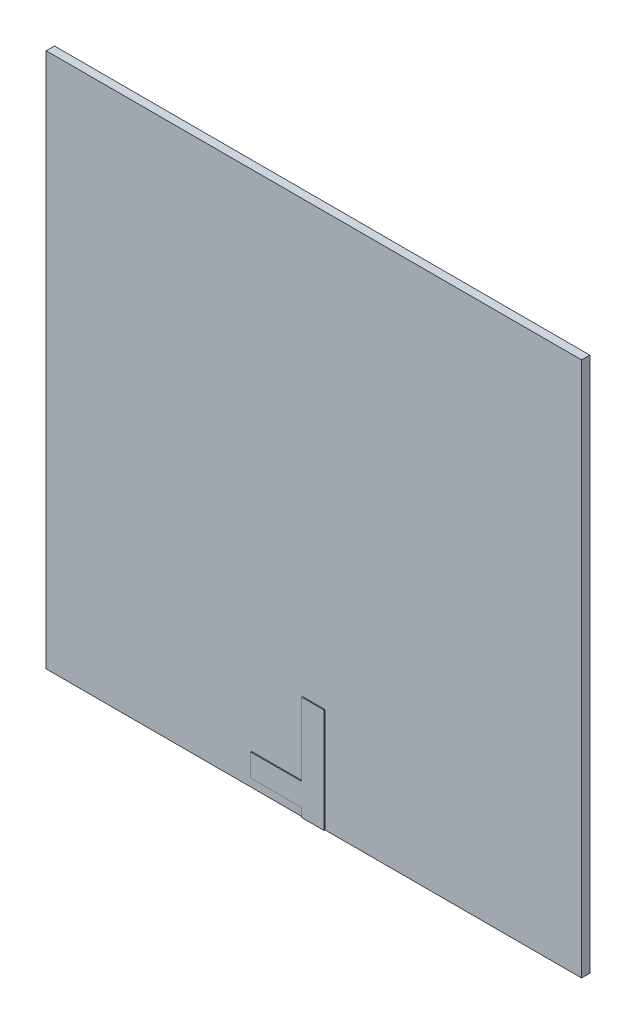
ISO-10303-21;
HEADER;
FILE_DESCRIPTION(('STEP AP214'),'2;1');
FILE_NAME('part.step','',(''),(''),'','','');
FILE_SCHEMA(('AUTOMOTIVE_DESIGN { 1 0 10303 214 1 1 1 1 }'));
ENDSEC;
DATA;
#1=APPLICATION_CONTEXT('core data for automotive mechanical design processes');
#2=APPLICATION_PROTOCOL_DEFINITION('international standard','automotive_design',2000,#1);
#3=PRODUCT_CONTEXT('',#1,'mechanical');
#4=PRODUCT('Part','Part','',(#3));
#5=PRODUCT_RELATED_PRODUCT_CATEGORY('part','',(#4));
#6=PRODUCT_DEFINITION_FORMATION('','',#4);
#7=PRODUCT_DEFINITION_CONTEXT('part definition',#1,'design');
#8=PRODUCT_DEFINITION('design','',#6,#7);
#9=PRODUCT_DEFINITION_SHAPE('','',#8);
#10=(LENGTH_UNIT() NAMED_UNIT(*) SI_UNIT(.MILLI.,.METRE.));
#11=(NAMED_UNIT(*) PLANE_ANGLE_UNIT() SI_UNIT($,.RADIAN.));
#12=(NAMED_UNIT(*) SI_UNIT($,.STERADIAN.) SOLID_ANGLE_UNIT());
#13=UNCERTAINTY_MEASURE_WITH_UNIT(LENGTH_MEASURE(1.E-05),#10,'distance_accuracy_value','');
#14=(GEOMETRIC_REPRESENTATION_CONTEXT(3) GLOBAL_UNCERTAINTY_ASSIGNED_CONTEXT((#13)) GLOBAL_UNIT_ASSIGNED_CONTEXT((#10,
#11,#12)) REPRESENTATION_CONTEXT('',''));
#15=CARTESIAN_POINT('',(0.,0.,0.));
#16=DIRECTION('',(0.,0.,1.));
#17=DIRECTION('',(1.,0.,0.));
#18=AXIS2_PLACEMENT_3D('',#15,#16,#17);
#19=CARTESIAN_POINT('',(-55.,55.,1.9));
#20=DIRECTION('',(1.,0.,0.));
#21=DIRECTION('',(0.,1.,0.));
#22=AXIS2_PLACEMENT_3D('',#19,#20,#21);
#23=PLANE('',#22);
#24=DIRECTION('',(0.,0.,-1.));
#25=VECTOR('',#24,1.);
#26=CARTESIAN_POINT('',(-55.,-55.,1.9));
#27=LINE('',#26,#25);
#28=CARTESIAN_POINT('',(-55.,-55.,1.7));
#29=VERTEX_POINT('',#28);
#30=CARTESIAN_POINT('',(-55.,-55.,0.));
#31=VERTEX_POINT('',#30);
#32=EDGE_CURVE('E11',#29,#31,#27,.T.);
#33=ORIENTED_EDGE('',*,*,#32,.F.);
#34=DIRECTION('',(0.,-1.,0.));
#35=VECTOR('',#34,1.);
#36=CARTESIAN_POINT('',(-55.,-55.,1.7));
#37=LINE('',#36,#35);
#38=CARTESIAN_POINT('',(-55.,55.,1.7));
#39=VERTEX_POINT('',#38);
#40=EDGE_CURVE('E185',#39,#29,#37,.T.);
#41=ORIENTED_EDGE('',*,*,#40,.F.);
#42=DIRECTION('',(0.,0.,-1.));
#43=VECTOR('',#42,1.);
#44=CARTESIAN_POINT('',(-55.,55.,1.9));
#45=LINE('',#44,#43);
#46=CARTESIAN_POINT('',(-55.,55.,0.));
#47=VERTEX_POINT('',#46);
#48=EDGE_CURVE('E62',#39,#47,#45,.T.);
#49=ORIENTED_EDGE('',*,*,#48,.T.);
#50=DIRECTION('',(0.,-1.,0.));
#51=VECTOR('',#50,1.);
#52=CARTESIAN_POINT('',(-55.,55.,0.));
#53=LINE('',#52,#51);
#54=EDGE_CURVE('E213',#47,#31,#53,.T.);
#55=ORIENTED_EDGE('',*,*,#54,.T.);
#56=EDGE_LOOP('',(#33,#41,#49,#55));
#57=FACE_BOUND('',#56,.T.);
#58=ADVANCED_FACE('F39',(#57),#23,.F.);
#59=CARTESIAN_POINT('',(-55.,-55.,1.9));
#60=DIRECTION('',(0.,1.,0.));
#61=DIRECTION('',(0.,0.,1.));
#62=AXIS2_PLACEMENT_3D('',#59,#60,#61);
#63=PLANE('',#62);
#64=DIRECTION('',(1.,0.,0.));
#65=VECTOR('',#64,1.);
#66=CARTESIAN_POINT('',(55.,-55.,1.7));
#67=LINE('',#66,#65);
#68=CARTESIAN_POINT('',(2.315,-55.,1.7));
#69=VERTEX_POINT('',#68);
#70=CARTESIAN_POINT('',(55.,-55.,1.7));
#71=VERTEX_POINT('',#70);
#72=EDGE_CURVE('E176',#69,#71,#67,.T.);
#73=ORIENTED_EDGE('',*,*,#72,.F.);
#74=DIRECTION('',(0.,0.,1.));
#75=VECTOR('',#74,1.);
#76=CARTESIAN_POINT('',(2.315,-55.,1.7));
#77=LINE('',#76,#75);
#78=CARTESIAN_POINT('',(2.315,-55.,1.9));
#79=VERTEX_POINT('',#78);
#80=EDGE_CURVE('E214',#69,#79,#77,.T.);
#81=ORIENTED_EDGE('',*,*,#80,.T.);
#82=DIRECTION('',(1.,0.,0.));
#83=VECTOR('',#82,1.);
#84=CARTESIAN_POINT('',(-55.,-55.,1.9));
#85=LINE('',#84,#83);
#86=CARTESIAN_POINT('',(-2.315,-55.,1.9));
#87=VERTEX_POINT('',#86);
#88=EDGE_CURVE('E232',#87,#79,#85,.T.);
#89=ORIENTED_EDGE('',*,*,#88,.F.);
#90=DIRECTION('',(0.,0.,1.));
#91=VECTOR('',#90,1.);
#92=CARTESIAN_POINT('',(-2.315,-55.,1.7));
#93=LINE('',#92,#91);
#94=CARTESIAN_POINT('',(-2.315,-55.,1.7));
#95=VERTEX_POINT('',#94);
#96=EDGE_CURVE('E210',#95,#87,#93,.T.);
#97=ORIENTED_EDGE('',*,*,#96,.F.);
#98=DIRECTION('',(1.,0.,0.));
#99=VECTOR('',#98,1.);
#100=CARTESIAN_POINT('',(-2.315,-55.,1.7));
#101=LINE('',#100,#99);
#102=EDGE_CURVE('E137',#29,#95,#101,.T.);
#103=ORIENTED_EDGE('',*,*,#102,.F.);
#104=ORIENTED_EDGE('',*,*,#32,.T.);
#105=DIRECTION('',(1.,0.,0.));
#106=VECTOR('',#105,1.);
#107=CARTESIAN_POINT('',(-55.,-55.,0.));
#108=LINE('',#107,#106);
#109=CARTESIAN_POINT('',(55.,-55.,0.));
#110=VERTEX_POINT('',#109);
#111=EDGE_CURVE('E239',#31,#110,#108,.T.);
#112=ORIENTED_EDGE('',*,*,#111,.T.);
#113=DIRECTION('',(0.,0.,-1.));
#114=VECTOR('',#113,1.);
#115=CARTESIAN_POINT('',(55.,-55.,1.9));
#116=LINE('',#115,#114);
#117=EDGE_CURVE('E47',#71,#110,#116,.T.);
#118=ORIENTED_EDGE('',*,*,#117,.F.);
#119=EDGE_LOOP('',(#73,#81,#89,#97,#103,#104,#112,#118));
#120=FACE_BOUND('',#119,.T.);
#121=ADVANCED_FACE('F264',(#120),#63,.F.);
#122=CARTESIAN_POINT('',(55.,55.,1.9));
#123=DIRECTION('',(-1.,0.,0.));
#124=DIRECTION('',(0.,-1.,0.));
#125=AXIS2_PLACEMENT_3D('',#122,#123,#124);
#126=PLANE('',#125);
#127=DIRECTION('',(0.,0.,-1.));
#128=VECTOR('',#127,1.);
#129=CARTESIAN_POINT('',(55.,55.,1.9));
#130=LINE('',#129,#128);
#131=CARTESIAN_POINT('',(55.,55.,1.7));
#132=VERTEX_POINT('',#131);
#133=CARTESIAN_POINT('',(55.,55.,0.));
#134=VERTEX_POINT('',#133);
#135=EDGE_CURVE('E251',#132,#134,#130,.T.);
#136=ORIENTED_EDGE('',*,*,#135,.F.);
#137=DIRECTION('',(0.,1.,0.));
#138=VECTOR('',#137,1.);
#139=CARTESIAN_POINT('',(55.,55.,1.7));
#140=LINE('',#139,#138);
#141=EDGE_CURVE('E179',#71,#132,#140,.T.);
#142=ORIENTED_EDGE('',*,*,#141,.F.);
#143=ORIENTED_EDGE('',*,*,#117,.T.);
#144=DIRECTION('',(0.,1.,0.));
#145=VECTOR('',#144,1.);
#146=CARTESIAN_POINT('',(55.,55.,0.));
#147=LINE('',#146,#145);
#148=EDGE_CURVE('E243',#110,#134,#147,.T.);
#149=ORIENTED_EDGE('',*,*,#148,.T.);
#150=EDGE_LOOP('',(#136,#142,#143,#149));
#151=FACE_BOUND('',#150,.T.);
#152=ADVANCED_FACE('F258',(#151),#126,.F.);
#153=CARTESIAN_POINT('',(-55.,55.,1.9));
#154=DIRECTION('',(0.,-1.,0.));
#155=DIRECTION('',(0.,0.,-1.));
#156=AXIS2_PLACEMENT_3D('',#153,#154,#155);
#157=PLANE('',#156);
#158=ORIENTED_EDGE('',*,*,#48,.F.);
#159=DIRECTION('',(-1.,0.,0.));
#160=VECTOR('',#159,1.);
#161=CARTESIAN_POINT('',(-55.,55.,1.7));
#162=LINE('',#161,#160);
#163=EDGE_CURVE('E182',#132,#39,#162,.T.);
#164=ORIENTED_EDGE('',*,*,#163,.F.);
#165=ORIENTED_EDGE('',*,*,#135,.T.);
#166=DIRECTION('',(-1.,0.,0.));
#167=VECTOR('',#166,1.);
#168=CARTESIAN_POINT('',(-55.,55.,0.));
#169=LINE('',#168,#167);
#170=EDGE_CURVE('E236',#134,#47,#169,.T.);
#171=ORIENTED_EDGE('',*,*,#170,.T.);
#172=EDGE_LOOP('',(#158,#164,#165,#171));
#173=FACE_BOUND('',#172,.T.);
#174=ADVANCED_FACE('F270',(#173),#157,.F.);
#175=CARTESIAN_POINT('',(0.,0.,1.9));
#176=DIRECTION('',(0.,0.,1.));
#177=DIRECTION('',(1.,0.,0.));
#178=AXIS2_PLACEMENT_3D('',#175,#176,#177);
#179=PLANE('',#178);
#180=DIRECTION('',(0.,1.,0.));
#181=VECTOR('',#180,1.);
#182=CARTESIAN_POINT('',(-2.315,-53.205,1.9));
#183=LINE('',#182,#181);
#184=CARTESIAN_POINT('',(-2.315,-53.205,1.9));
#185=VERTEX_POINT('',#184);
#186=EDGE_CURVE('E54',#87,#185,#183,.T.);
#187=ORIENTED_EDGE('',*,*,#186,.F.);
#188=ORIENTED_EDGE('',*,*,#88,.T.);
#189=DIRECTION('',(0.,-1.,0.));
#190=VECTOR('',#189,1.);
#191=CARTESIAN_POINT('',(2.315,-55.,1.9));
#192=LINE('',#191,#190);
#193=CARTESIAN_POINT('',(2.315,-33.575,1.9));
#194=VERTEX_POINT('',#193);
#195=EDGE_CURVE('E152',#194,#79,#192,.T.);
#196=ORIENTED_EDGE('',*,*,#195,.F.);
#197=DIRECTION('',(1.,0.,0.));
#198=VECTOR('',#197,1.);
#199=CARTESIAN_POINT('',(2.315,-33.575,1.9));
#200=LINE('',#199,#198);
#201=CARTESIAN_POINT('',(-2.315,-33.575,1.9));
#202=VERTEX_POINT('',#201);
#203=EDGE_CURVE('E155',#202,#194,#200,.T.);
#204=ORIENTED_EDGE('',*,*,#203,.F.);
#205=DIRECTION('',(0.,1.,0.));
#206=VECTOR('',#205,1.);
#207=CARTESIAN_POINT('',(-2.315,-33.575,1.9));
#208=LINE('',#207,#206);
#209=CARTESIAN_POINT('',(-2.315,-48.575,1.9));
#210=VERTEX_POINT('',#209);
#211=EDGE_CURVE('E203',#210,#202,#208,.T.);
#212=ORIENTED_EDGE('',*,*,#211,.F.);
#213=DIRECTION('',(1.,0.,0.));
#214=VECTOR('',#213,1.);
#215=CARTESIAN_POINT('',(-2.315,-48.575,1.9));
#216=LINE('',#215,#214);
#217=CARTESIAN_POINT('',(-12.815,-48.575,1.9));
#218=VERTEX_POINT('',#217);
#219=EDGE_CURVE('E199',#218,#210,#216,.T.);
#220=ORIENTED_EDGE('',*,*,#219,.F.);
#221=DIRECTION('',(0.,1.,0.));
#222=VECTOR('',#221,1.);
#223=CARTESIAN_POINT('',(-12.815,-48.575,1.9));
#224=LINE('',#223,#222);
#225=CARTESIAN_POINT('',(-12.815,-53.205,1.9));
#226=VERTEX_POINT('',#225);
#227=EDGE_CURVE('E195',#226,#218,#224,.T.);
#228=ORIENTED_EDGE('',*,*,#227,.F.);
#229=DIRECTION('',(-1.,0.,0.));
#230=VECTOR('',#229,1.);
#231=CARTESIAN_POINT('',(-12.815,-53.205,1.9));
#232=LINE('',#231,#230);
#233=EDGE_CURVE('E192',#185,#226,#232,.T.);
#234=ORIENTED_EDGE('',*,*,#233,.F.);
#235=EDGE_LOOP('',(#187,#188,#196,#204,#212,#220,#228,#234));
#236=FACE_BOUND('',#235,.T.);
#237=ADVANCED_FACE('F283',(#236),#179,.T.);
#238=CARTESIAN_POINT('',(0.,0.,0.));
#239=DIRECTION('',(0.,0.,1.));
#240=DIRECTION('',(1.,0.,0.));
#241=AXIS2_PLACEMENT_3D('',#238,#239,#240);
#242=PLANE('',#241);
#243=ORIENTED_EDGE('',*,*,#54,.F.);
#244=ORIENTED_EDGE('',*,*,#170,.F.);
#245=ORIENTED_EDGE('',*,*,#148,.F.);
#246=ORIENTED_EDGE('',*,*,#111,.F.);
#247=EDGE_LOOP('',(#243,#244,#245,#246));
#248=FACE_BOUND('',#247,.T.);
#249=ADVANCED_FACE('F268',(#248),#242,.F.);
#250=CARTESIAN_POINT('',(-2.315,-53.205,1.7));
#251=DIRECTION('',(1.,0.,0.));
#252=DIRECTION('',(0.,0.,-1.));
#253=AXIS2_PLACEMENT_3D('',#250,#251,#252);
#254=PLANE('',#253);
#255=ORIENTED_EDGE('',*,*,#186,.T.);
#256=DIRECTION('',(0.,0.,1.));
#257=VECTOR('',#256,1.);
#258=CARTESIAN_POINT('',(-2.315,-53.205,1.7));
#259=LINE('',#258,#257);
#260=CARTESIAN_POINT('',(-2.315,-53.205,1.7));
#261=VERTEX_POINT('',#260);
#262=EDGE_CURVE('E126',#261,#185,#259,.T.);
#263=ORIENTED_EDGE('',*,*,#262,.F.);
#264=DIRECTION('',(0.,1.,0.));
#265=VECTOR('',#264,1.);
#266=CARTESIAN_POINT('',(-2.315,-53.205,1.7));
#267=LINE('',#266,#265);
#268=EDGE_CURVE('E130',#95,#261,#267,.T.);
#269=ORIENTED_EDGE('',*,*,#268,.F.);
#270=ORIENTED_EDGE('',*,*,#96,.T.);
#271=EDGE_LOOP('',(#255,#263,#269,#270));
#272=FACE_BOUND('',#271,.T.);
#273=ADVANCED_FACE('F128',(#272),#254,.F.);
#274=CARTESIAN_POINT('',(2.315,-55.,1.7));
#275=DIRECTION('',(-1.,0.,0.));
#276=DIRECTION('',(0.,-1.,0.));
#277=AXIS2_PLACEMENT_3D('',#274,#275,#276);
#278=PLANE('',#277);
#279=ORIENTED_EDGE('',*,*,#195,.T.);
#280=ORIENTED_EDGE('',*,*,#80,.F.);
#281=DIRECTION('',(0.,-1.,0.));
#282=VECTOR('',#281,1.);
#283=CARTESIAN_POINT('',(2.315,-55.,1.7));
#284=LINE('',#283,#282);
#285=CARTESIAN_POINT('',(2.315,-33.575,1.7));
#286=VERTEX_POINT('',#285);
#287=EDGE_CURVE('E172',#286,#69,#284,.T.);
#288=ORIENTED_EDGE('',*,*,#287,.F.);
#289=DIRECTION('',(0.,0.,1.));
#290=VECTOR('',#289,1.);
#291=CARTESIAN_POINT('',(2.315,-33.575,1.7));
#292=LINE('',#291,#290);
#293=EDGE_CURVE('E218',#286,#194,#292,.T.);
#294=ORIENTED_EDGE('',*,*,#293,.T.);
#295=EDGE_LOOP('',(#279,#280,#288,#294));
#296=FACE_BOUND('',#295,.T.);
#297=ADVANCED_FACE('F291',(#296),#278,.F.);
#298=CARTESIAN_POINT('',(2.315,-33.575,1.7));
#299=DIRECTION('',(0.,-1.,0.));
#300=DIRECTION('',(0.,0.,-1.));
#301=AXIS2_PLACEMENT_3D('',#298,#299,#300);
#302=PLANE('',#301);
#303=ORIENTED_EDGE('',*,*,#203,.T.);
#304=ORIENTED_EDGE('',*,*,#293,.F.);
#305=DIRECTION('',(1.,0.,0.));
#306=VECTOR('',#305,1.);
#307=CARTESIAN_POINT('',(2.315,-33.575,1.7));
#308=LINE('',#307,#306);
#309=CARTESIAN_POINT('',(-2.315,-33.575,1.7));
#310=VERTEX_POINT('',#309);
#311=EDGE_CURVE('E168',#310,#286,#308,.T.);
#312=ORIENTED_EDGE('',*,*,#311,.F.);
#313=DIRECTION('',(0.,0.,1.));
#314=VECTOR('',#313,1.);
#315=CARTESIAN_POINT('',(-2.315,-33.575,1.7));
#316=LINE('',#315,#314);
#317=EDGE_CURVE('E221',#310,#202,#316,.T.);
#318=ORIENTED_EDGE('',*,*,#317,.T.);
#319=EDGE_LOOP('',(#303,#304,#312,#318));
#320=FACE_BOUND('',#319,.T.);
#321=ADVANCED_FACE('F305',(#320),#302,.F.);
#322=CARTESIAN_POINT('',(-2.315,-33.575,1.7));
#323=DIRECTION('',(1.,0.,0.));
#324=DIRECTION('',(0.,0.,-1.));
#325=AXIS2_PLACEMENT_3D('',#322,#323,#324);
#326=PLANE('',#325);
#327=ORIENTED_EDGE('',*,*,#211,.T.);
#328=ORIENTED_EDGE('',*,*,#317,.F.);
#329=DIRECTION('',(0.,1.,0.));
#330=VECTOR('',#329,1.);
#331=CARTESIAN_POINT('',(-2.315,-33.575,1.7));
#332=LINE('',#331,#330);
#333=CARTESIAN_POINT('',(-2.315,-48.575,1.7));
#334=VERTEX_POINT('',#333);
#335=EDGE_CURVE('E164',#334,#310,#332,.T.);
#336=ORIENTED_EDGE('',*,*,#335,.F.);
#337=DIRECTION('',(0.,0.,1.));
#338=VECTOR('',#337,1.);
#339=CARTESIAN_POINT('',(-2.315,-48.575,1.7));
#340=LINE('',#339,#338);
#341=EDGE_CURVE('E224',#334,#210,#340,.T.);
#342=ORIENTED_EDGE('',*,*,#341,.T.);
#343=EDGE_LOOP('',(#327,#328,#336,#342));
#344=FACE_BOUND('',#343,.T.);
#345=ADVANCED_FACE('F301',(#344),#326,.F.);
#346=CARTESIAN_POINT('',(-2.315,-48.575,1.7));
#347=DIRECTION('',(0.,-1.,0.));
#348=DIRECTION('',(0.,0.,-1.));
#349=AXIS2_PLACEMENT_3D('',#346,#347,#348);
#350=PLANE('',#349);
#351=ORIENTED_EDGE('',*,*,#219,.T.);
#352=ORIENTED_EDGE('',*,*,#341,.F.);
#353=DIRECTION('',(1.,0.,0.));
#354=VECTOR('',#353,1.);
#355=CARTESIAN_POINT('',(-2.315,-48.575,1.7));
#356=LINE('',#355,#354);
#357=CARTESIAN_POINT('',(-12.815,-48.575,1.7));
#358=VERTEX_POINT('',#357);
#359=EDGE_CURVE('E160',#358,#334,#356,.T.);
#360=ORIENTED_EDGE('',*,*,#359,.F.);
#361=DIRECTION('',(0.,0.,1.));
#362=VECTOR('',#361,1.);
#363=CARTESIAN_POINT('',(-12.815,-48.575,1.7));
#364=LINE('',#363,#362);
#365=EDGE_CURVE('E227',#358,#218,#364,.T.);
#366=ORIENTED_EDGE('',*,*,#365,.T.);
#367=EDGE_LOOP('',(#351,#352,#360,#366));
#368=FACE_BOUND('',#367,.T.);
#369=ADVANCED_FACE('F297',(#368),#350,.F.);
#370=CARTESIAN_POINT('',(-12.815,-48.575,1.7));
#371=DIRECTION('',(1.,0.,0.));
#372=DIRECTION('',(0.,0.,-1.));
#373=AXIS2_PLACEMENT_3D('',#370,#371,#372);
#374=PLANE('',#373);
#375=ORIENTED_EDGE('',*,*,#227,.T.);
#376=ORIENTED_EDGE('',*,*,#365,.F.);
#377=DIRECTION('',(0.,1.,0.));
#378=VECTOR('',#377,1.);
#379=CARTESIAN_POINT('',(-12.815,-48.575,1.7));
#380=LINE('',#379,#378);
#381=CARTESIAN_POINT('',(-12.815,-53.205,1.7));
#382=VERTEX_POINT('',#381);
#383=EDGE_CURVE('E146',#382,#358,#380,.T.);
#384=ORIENTED_EDGE('',*,*,#383,.F.);
#385=DIRECTION('',(0.,0.,1.));
#386=VECTOR('',#385,1.);
#387=CARTESIAN_POINT('',(-12.815,-53.205,1.7));
#388=LINE('',#387,#386);
#389=EDGE_CURVE('E136',#382,#226,#388,.T.);
#390=ORIENTED_EDGE('',*,*,#389,.T.);
#391=EDGE_LOOP('',(#375,#376,#384,#390));
#392=FACE_BOUND('',#391,.T.);
#393=ADVANCED_FACE('F294',(#392),#374,.F.);
#394=CARTESIAN_POINT('',(-12.815,-53.205,1.7));
#395=DIRECTION('',(0.,1.,0.));
#396=DIRECTION('',(0.,0.,1.));
#397=AXIS2_PLACEMENT_3D('',#394,#395,#396);
#398=PLANE('',#397);
#399=ORIENTED_EDGE('',*,*,#233,.T.);
#400=ORIENTED_EDGE('',*,*,#389,.F.);
#401=DIRECTION('',(-1.,0.,0.));
#402=VECTOR('',#401,1.);
#403=CARTESIAN_POINT('',(-12.815,-53.205,1.7));
#404=LINE('',#403,#402);
#405=EDGE_CURVE('E140',#261,#382,#404,.T.);
#406=ORIENTED_EDGE('',*,*,#405,.F.);
#407=ORIENTED_EDGE('',*,*,#262,.T.);
#408=EDGE_LOOP('',(#399,#400,#406,#407));
#409=FACE_BOUND('',#408,.T.);
#410=ADVANCED_FACE('F141',(#409),#398,.F.);
#411=CARTESIAN_POINT('',(0.,0.,1.7));
#412=DIRECTION('',(0.,0.,-1.));
#413=DIRECTION('',(-1.,0.,0.));
#414=AXIS2_PLACEMENT_3D('',#411,#412,#413);
#415=PLANE('',#414);
#416=ORIENTED_EDGE('',*,*,#268,.T.);
#417=ORIENTED_EDGE('',*,*,#405,.T.);
#418=ORIENTED_EDGE('',*,*,#383,.T.);
#419=ORIENTED_EDGE('',*,*,#359,.T.);
#420=ORIENTED_EDGE('',*,*,#335,.T.);
#421=ORIENTED_EDGE('',*,*,#311,.T.);
#422=ORIENTED_EDGE('',*,*,#287,.T.);
#423=ORIENTED_EDGE('',*,*,#72,.T.);
#424=ORIENTED_EDGE('',*,*,#141,.T.);
#425=ORIENTED_EDGE('',*,*,#163,.T.);
#426=ORIENTED_EDGE('',*,*,#40,.T.);
#427=ORIENTED_EDGE('',*,*,#102,.T.);
#428=EDGE_LOOP('',(#416,#417,#418,#419,#420,#421,#422,#423,#424,#425,#426,#427));
#429=FACE_BOUND('',#428,.T.);
#430=ADVANCED_FACE('F148',(#429),#415,.F.);
#431=CLOSED_SHELL('',(#58,#121,#152,#174,#237,#249,#273,#297,#321,#345,#369,#393,#410,#430));
#432=MANIFOLD_SOLID_BREP('B2',#431);
#433=ADVANCED_BREP_SHAPE_REPRESENTATION('',(#18,#432),#14);
#434=SHAPE_DEFINITION_REPRESENTATION(#9,#433);
ENDSEC;
END-ISO-10303-21;
